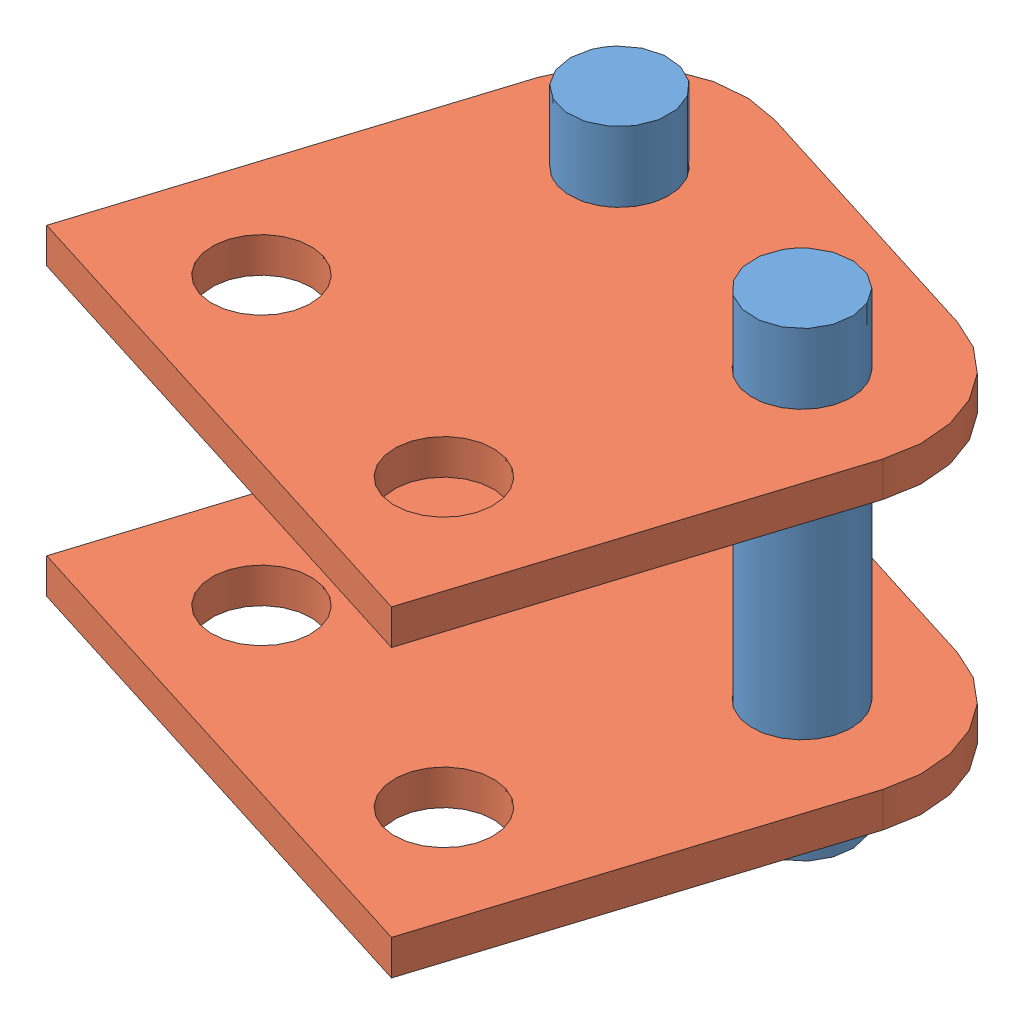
SolidWorks assembly Aussenglied_5.SLDASM, configuration Standard (file format 3400). Lengths in mm.
Overall size (29.94 21 29.62).
4 component instances, 2 part files, 8 mates.
Components (placement in the parent):
- Bolzen-1: Bolzen.SLDPRT [Standard] at (-9.5236 8.1816 3.2787) x (-0.767613 0 -0.640914) z (0 -1 0) size (4.5 4.5 21)
- Flachlasche-3: Flachlasche.SLDPRT [Standard] at (-25.3339 4.9966 -7.6153) x (0.953953 0 0.299956) z (0 -1 0) size (24 23.5 1.6)
- Flachlasche-4: Flachlasche.SLDPRT [Standard] at (-2.439 -9.6334 -0.4163) x (-0.953953 0 -0.299956) z (0 1 0) size (24 23.5 1.6)
- Bolzen-4: Bolzen.SLDPRT [Standard] at (-21.6388 8.1816 -0.5307) x (-0.848156 0 -0.529746) z (0 -1 0) size (4.5 4.5 21)
Mates (geometry in assembly coordinates):
- Konzentrisch8: concentric aligned: cylinder of Bolzen-1; cylinder of Flachlasche-4
- Konzentrisch9: concentric anti-aligned: cylinder of Bolzen-1; cylinder of Flachlasche-3
- Abstand3: distance = 11.43 mm: line of Flachlasche-3; line of Flachlasche-4
- Abstand5: distance = 3.185 mm aligned: plane of Bolzen-1 through (-9.5236 -12.8184 3.2787) normal (0 -1 0); plane of Flachlasche-4 through (-9.5236 -9.6334 3.2787) normal (0 -1 0)
- Konzentrisch12: concentric anti-aligned: cylinder of Flachlasche-3; cylinder of Bolzen-4
- Konzentrisch13: concentric aligned: cylinder of Flachlasche-4; cylinder of Bolzen-4
- Abstand11: distance = 3.185 mm aligned: plane of Flachlasche-4 through (-9.5236 -9.6334 3.2787) normal (0 -1 0); plane of Bolzen-4 through (-21.6388 -12.8184 -0.5307) normal (0 -1 0)
- EBENE2: unknown = 5.715 mm: unknown of Flachlasche-3
